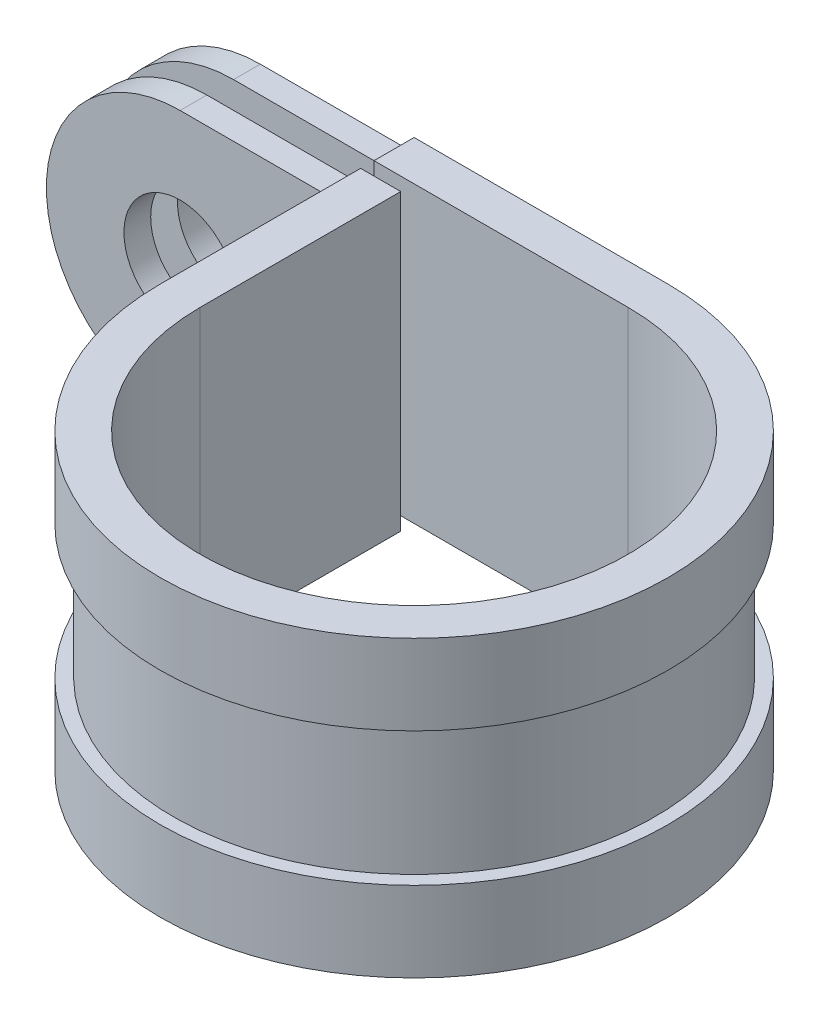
ISO-10303-21;
HEADER;
FILE_DESCRIPTION(('STEP AP214'),'2;1');
FILE_NAME('part.step','',(''),(''),'','','');
FILE_SCHEMA(('AUTOMOTIVE_DESIGN { 1 0 10303 214 1 1 1 1 }'));
ENDSEC;
DATA;
#1=APPLICATION_CONTEXT('core data for automotive mechanical design processes');
#2=APPLICATION_PROTOCOL_DEFINITION('international standard','automotive_design',2000,#1);
#3=PRODUCT_CONTEXT('',#1,'mechanical');
#4=PRODUCT('Part','Part','',(#3));
#5=PRODUCT_RELATED_PRODUCT_CATEGORY('part','',(#4));
#6=PRODUCT_DEFINITION_FORMATION('','',#4);
#7=PRODUCT_DEFINITION_CONTEXT('part definition',#1,'design');
#8=PRODUCT_DEFINITION('design','',#6,#7);
#9=PRODUCT_DEFINITION_SHAPE('','',#8);
#10=(LENGTH_UNIT() NAMED_UNIT(*) SI_UNIT(.MILLI.,.METRE.));
#11=(NAMED_UNIT(*) PLANE_ANGLE_UNIT() SI_UNIT($,.RADIAN.));
#12=(NAMED_UNIT(*) SI_UNIT($,.STERADIAN.) SOLID_ANGLE_UNIT());
#13=UNCERTAINTY_MEASURE_WITH_UNIT(LENGTH_MEASURE(1.E-05),#10,'distance_accuracy_value','');
#14=(GEOMETRIC_REPRESENTATION_CONTEXT(3) GLOBAL_UNCERTAINTY_ASSIGNED_CONTEXT((#13)) GLOBAL_UNIT_ASSIGNED_CONTEXT((#10,
#11,#12)) REPRESENTATION_CONTEXT('',''));
#15=CARTESIAN_POINT('',(0.,0.,0.));
#16=DIRECTION('',(0.,0.,1.));
#17=DIRECTION('',(1.,0.,0.));
#18=AXIS2_PLACEMENT_3D('',#15,#16,#17);
#19=CARTESIAN_POINT('',(104.5,35.5,1071.));
#20=DIRECTION('',(0.,0.,1.));
#21=DIRECTION('',(1.,0.,0.));
#22=AXIS2_PLACEMENT_3D('',#19,#20,#21);
#23=PLANE('',#22);
#24=DIRECTION('',(0.,1.,0.));
#25=VECTOR('',#24,1.);
#26=CARTESIAN_POINT('',(85.5,40.5,1071.));
#27=LINE('',#26,#25);
#28=CARTESIAN_POINT('',(85.5,45.5,1071.));
#29=VERTEX_POINT('',#28);
#30=CARTESIAN_POINT('',(85.5,35.5,1071.));
#31=VERTEX_POINT('',#30);
#32=EDGE_CURVE('E339',#29,#31,#27,.F.);
#33=ORIENTED_EDGE('',*,*,#32,.F.);
#34=DIRECTION('',(1.,0.,0.));
#35=VECTOR('',#34,1.);
#36=CARTESIAN_POINT('',(104.5,45.5,1071.));
#37=LINE('',#36,#35);
#38=CARTESIAN_POINT('',(104.5,45.5,1071.));
#39=VERTEX_POINT('',#38);
#40=EDGE_CURVE('E142',#29,#39,#37,.T.);
#41=ORIENTED_EDGE('',*,*,#40,.T.);
#42=DIRECTION('',(0.,-1.,0.));
#43=VECTOR('',#42,1.);
#44=CARTESIAN_POINT('',(104.5,29.5,1071.));
#45=LINE('',#44,#43);
#46=CARTESIAN_POINT('',(104.5,35.5,1071.));
#47=VERTEX_POINT('',#46);
#48=EDGE_CURVE('E128',#47,#39,#45,.F.);
#49=ORIENTED_EDGE('',*,*,#48,.F.);
#50=DIRECTION('',(1.,0.,0.));
#51=VECTOR('',#50,1.);
#52=CARTESIAN_POINT('',(104.5,35.5,1071.));
#53=LINE('',#52,#51);
#54=EDGE_CURVE('E328',#31,#47,#53,.T.);
#55=ORIENTED_EDGE('',*,*,#54,.F.);
#56=EDGE_LOOP('',(#33,#41,#49,#55));
#57=FACE_BOUND('',#56,.T.);
#58=ADVANCED_FACE('F24',(#57),#23,.F.);
#59=CARTESIAN_POINT('',(104.5,29.5,1089.));
#60=DIRECTION('',(0.,-1.,0.));
#61=DIRECTION('',(1.,0.,0.));
#62=AXIS2_PLACEMENT_3D('',#59,#60,#61);
#63=CYLINDRICAL_SURFACE('',#62,18.);
#64=DIRECTION('',(0.,-1.,0.));
#65=VECTOR('',#64,1.);
#66=CARTESIAN_POINT('',(86.5,35.5,1089.));
#67=LINE('',#66,#65);
#68=CARTESIAN_POINT('',(86.5,35.5,1089.));
#69=VERTEX_POINT('',#68);
#70=CARTESIAN_POINT('',(86.5,45.5,1089.));
#71=VERTEX_POINT('',#70);
#72=EDGE_CURVE('E136',#69,#71,#67,.F.);
#73=ORIENTED_EDGE('',*,*,#72,.F.);
#74=CARTESIAN_POINT('',(104.5,35.5,1089.));
#75=DIRECTION('',(0.,-1.,0.));
#76=DIRECTION('',(1.,0.,0.));
#77=AXIS2_PLACEMENT_3D('',#74,#75,#76);
#78=CIRCLE('',#77,18.);
#79=EDGE_CURVE('E327',#47,#69,#78,.T.);
#80=ORIENTED_EDGE('',*,*,#79,.F.);
#81=ORIENTED_EDGE('',*,*,#48,.T.);
#82=CARTESIAN_POINT('',(104.5,45.5,1089.));
#83=DIRECTION('',(0.,-1.,0.));
#84=DIRECTION('',(1.,0.,0.));
#85=AXIS2_PLACEMENT_3D('',#82,#83,#84);
#86=CIRCLE('',#85,18.);
#87=EDGE_CURVE('E27',#39,#71,#86,.T.);
#88=ORIENTED_EDGE('',*,*,#87,.T.);
#89=EDGE_LOOP('',(#73,#80,#81,#88));
#90=FACE_BOUND('',#89,.T.);
#91=ADVANCED_FACE('F383',(#90),#63,.T.);
#92=CARTESIAN_POINT('',(86.5,35.5,1089.));
#93=DIRECTION('',(-1.,0.,0.));
#94=DIRECTION('',(0.,-1.,0.));
#95=AXIS2_PLACEMENT_3D('',#92,#93,#94);
#96=PLANE('',#95);
#97=ORIENTED_EDGE('',*,*,#72,.T.);
#98=DIRECTION('',(0.,0.,1.));
#99=VECTOR('',#98,1.);
#100=CARTESIAN_POINT('',(86.5,45.5,1071.));
#101=LINE('',#100,#99);
#102=CARTESIAN_POINT('',(86.5,45.5,1076.));
#103=VERTEX_POINT('',#102);
#104=EDGE_CURVE('E343',#71,#103,#101,.F.);
#105=ORIENTED_EDGE('',*,*,#104,.T.);
#106=DIRECTION('',(0.,1.,0.));
#107=VECTOR('',#106,1.);
#108=CARTESIAN_POINT('',(86.5,40.5,1076.));
#109=LINE('',#108,#107);
#110=CARTESIAN_POINT('',(86.5,35.5,1076.));
#111=VERTEX_POINT('',#110);
#112=EDGE_CURVE('E319',#111,#103,#109,.T.);
#113=ORIENTED_EDGE('',*,*,#112,.F.);
#114=DIRECTION('',(0.,0.,1.));
#115=VECTOR('',#114,1.);
#116=CARTESIAN_POINT('',(86.5,35.5,1071.));
#117=LINE('',#116,#115);
#118=EDGE_CURVE('E324',#69,#111,#117,.F.);
#119=ORIENTED_EDGE('',*,*,#118,.F.);
#120=EDGE_LOOP('',(#97,#105,#113,#119));
#121=FACE_BOUND('',#120,.T.);
#122=ADVANCED_FACE('F385',(#121),#96,.T.);
#123=CARTESIAN_POINT('',(74.,40.5,1070.));
#124=DIRECTION('',(0.,0.,1.));
#125=DIRECTION('',(1.,0.,0.));
#126=AXIS2_PLACEMENT_3D('',#123,#124,#125);
#127=CYLINDRICAL_SURFACE('',#126,10.);
#128=CARTESIAN_POINT('',(74.,40.5,1070.));
#129=DIRECTION('',(0.,0.,1.));
#130=DIRECTION('',(1.,0.,0.));
#131=AXIS2_PLACEMENT_3D('',#128,#129,#130);
#132=CIRCLE('',#131,10.);
#133=CARTESIAN_POINT('',(74.,30.5,1070.));
#134=VERTEX_POINT('',#133);
#135=CARTESIAN_POINT('',(74.,50.5,1070.));
#136=VERTEX_POINT('',#135);
#137=EDGE_CURVE('E273',#134,#136,#132,.F.);
#138=ORIENTED_EDGE('',*,*,#137,.F.);
#139=DIRECTION('',(0.,0.,1.));
#140=VECTOR('',#139,1.);
#141=CARTESIAN_POINT('',(74.,30.5,1071.));
#142=LINE('',#141,#140);
#143=CARTESIAN_POINT('',(74.,30.5,1072.));
#144=VERTEX_POINT('',#143);
#145=EDGE_CURVE('E348',#144,#134,#142,.F.);
#146=ORIENTED_EDGE('',*,*,#145,.F.);
#147=CARTESIAN_POINT('',(74.,40.5,1072.));
#148=DIRECTION('',(0.,0.,1.));
#149=DIRECTION('',(1.,0.,0.));
#150=AXIS2_PLACEMENT_3D('',#147,#148,#149);
#151=CIRCLE('',#150,10.);
#152=CARTESIAN_POINT('',(74.,50.5,1072.));
#153=VERTEX_POINT('',#152);
#154=EDGE_CURVE('E299',#153,#144,#151,.T.);
#155=ORIENTED_EDGE('',*,*,#154,.F.);
#156=DIRECTION('',(0.,0.,1.));
#157=VECTOR('',#156,1.);
#158=CARTESIAN_POINT('',(74.,50.5,1071.));
#159=LINE('',#158,#157);
#160=EDGE_CURVE('E294',#136,#153,#159,.T.);
#161=ORIENTED_EDGE('',*,*,#160,.F.);
#162=EDGE_LOOP('',(#138,#146,#155,#161));
#163=FACE_BOUND('',#162,.T.);
#164=ADVANCED_FACE('F511',(#163),#127,.T.);
#165=CARTESIAN_POINT('',(104.5,45.5,1071.));
#166=DIRECTION('',(0.,1.,0.));
#167=DIRECTION('',(0.,0.,1.));
#168=AXIS2_PLACEMENT_3D('',#165,#166,#167);
#169=PLANE('',#168);
#170=DIRECTION('',(1.,0.,0.));
#171=VECTOR('',#170,1.);
#172=CARTESIAN_POINT('',(74.,45.5,1076.));
#173=LINE('',#172,#171);
#174=CARTESIAN_POINT('',(85.5,45.5,1076.));
#175=VERTEX_POINT('',#174);
#176=EDGE_CURVE('E326',#103,#175,#173,.F.);
#177=ORIENTED_EDGE('',*,*,#176,.F.);
#178=ORIENTED_EDGE('',*,*,#104,.F.);
#179=ORIENTED_EDGE('',*,*,#87,.F.);
#180=ORIENTED_EDGE('',*,*,#40,.F.);
#181=DIRECTION('',(0.,0.,1.));
#182=VECTOR('',#181,1.);
#183=CARTESIAN_POINT('',(85.5,45.5,1071.));
#184=LINE('',#183,#182);
#185=CARTESIAN_POINT('',(85.5,45.5,1070.));
#186=VERTEX_POINT('',#185);
#187=EDGE_CURVE('E341',#186,#29,#184,.T.);
#188=ORIENTED_EDGE('',*,*,#187,.F.);
#189=DIRECTION('',(-1.,0.,0.));
#190=VECTOR('',#189,1.);
#191=CARTESIAN_POINT('',(104.5,45.5,1070.));
#192=LINE('',#191,#190);
#193=CARTESIAN_POINT('',(104.5,45.5,1070.));
#194=VERTEX_POINT('',#193);
#195=EDGE_CURVE('E281',#194,#186,#192,.T.);
#196=ORIENTED_EDGE('',*,*,#195,.F.);
#197=CARTESIAN_POINT('',(104.5,45.5,1089.));
#198=DIRECTION('',(0.,-1.,0.));
#199=DIRECTION('',(1.,0.,0.));
#200=AXIS2_PLACEMENT_3D('',#197,#198,#199);
#201=CIRCLE('',#200,19.);
#202=CARTESIAN_POINT('',(85.5,45.5,1089.));
#203=VERTEX_POINT('',#202);
#204=EDGE_CURVE('E293',#203,#194,#201,.F.);
#205=ORIENTED_EDGE('',*,*,#204,.F.);
#206=DIRECTION('',(0.,0.,1.));
#207=VECTOR('',#206,1.);
#208=CARTESIAN_POINT('',(85.5,45.5,1089.));
#209=LINE('',#208,#207);
#210=EDGE_CURVE('E287',#175,#203,#209,.T.);
#211=ORIENTED_EDGE('',*,*,#210,.F.);
#212=EDGE_LOOP('',(#177,#178,#179,#180,#188,#196,#205,#211));
#213=FACE_BOUND('',#212,.T.);
#214=ADVANCED_FACE('F391',(#213),#169,.F.);
#215=CARTESIAN_POINT('',(85.5,40.5,1071.));
#216=DIRECTION('',(1.,0.,0.));
#217=DIRECTION('',(0.,1.,0.));
#218=AXIS2_PLACEMENT_3D('',#215,#216,#217);
#219=PLANE('',#218);
#220=DIRECTION('',(0.,0.,1.));
#221=VECTOR('',#220,1.);
#222=CARTESIAN_POINT('',(85.5,35.5,1071.));
#223=LINE('',#222,#221);
#224=CARTESIAN_POINT('',(85.5,35.5,1070.));
#225=VERTEX_POINT('',#224);
#226=EDGE_CURVE('E330',#225,#31,#223,.T.);
#227=ORIENTED_EDGE('',*,*,#226,.F.);
#228=DIRECTION('',(0.,1.,0.));
#229=VECTOR('',#228,1.);
#230=CARTESIAN_POINT('',(85.5,35.5,1070.));
#231=LINE('',#230,#229);
#232=EDGE_CURVE('E336',#186,#225,#231,.F.);
#233=ORIENTED_EDGE('',*,*,#232,.F.);
#234=ORIENTED_EDGE('',*,*,#187,.T.);
#235=ORIENTED_EDGE('',*,*,#32,.T.);
#236=EDGE_LOOP('',(#227,#233,#234,#235));
#237=FACE_BOUND('',#236,.T.);
#238=ADVANCED_FACE('F430',(#237),#219,.T.);
#239=CARTESIAN_POINT('',(74.,40.5,1072.));
#240=DIRECTION('',(0.,0.,-1.));
#241=DIRECTION('',(-1.,0.,0.));
#242=AXIS2_PLACEMENT_3D('',#239,#240,#241);
#243=CYLINDRICAL_SURFACE('',#242,4.2);
#244=CARTESIAN_POINT('',(74.,40.5,1072.));
#245=DIRECTION('',(0.,0.,-1.));
#246=DIRECTION('',(-1.,0.,0.));
#247=AXIS2_PLACEMENT_3D('',#244,#245,#246);
#248=CIRCLE('',#247,4.2);
#249=CARTESIAN_POINT('',(69.8,40.5,1072.));
#250=VERTEX_POINT('',#249);
#251=EDGE_CURVE('E350',#250,#250,#248,.T.);
#252=ORIENTED_EDGE('',*,*,#251,.F.);
#253=EDGE_LOOP('',(#252));
#254=FACE_BOUND('',#253,.T.);
#255=CARTESIAN_POINT('',(74.,40.5,1070.));
#256=DIRECTION('',(0.,0.,-1.));
#257=DIRECTION('',(-1.,0.,0.));
#258=AXIS2_PLACEMENT_3D('',#255,#256,#257);
#259=CIRCLE('',#258,4.2);
#260=CARTESIAN_POINT('',(69.8,40.5,1070.));
#261=VERTEX_POINT('',#260);
#262=EDGE_CURVE('E269',#261,#261,#259,.F.);
#263=ORIENTED_EDGE('',*,*,#262,.F.);
#264=EDGE_LOOP('',(#263));
#265=FACE_BOUND('',#264,.T.);
#266=ADVANCED_FACE('F503',(#254,#265),#243,.F.);
#267=CARTESIAN_POINT('',(104.5,35.5,1071.));
#268=DIRECTION('',(0.,1.,0.));
#269=DIRECTION('',(0.,0.,1.));
#270=AXIS2_PLACEMENT_3D('',#267,#268,#269);
#271=PLANE('',#270);
#272=ORIENTED_EDGE('',*,*,#79,.T.);
#273=ORIENTED_EDGE('',*,*,#118,.T.);
#274=DIRECTION('',(1.,0.,0.));
#275=VECTOR('',#274,1.);
#276=CARTESIAN_POINT('',(74.,35.5,1076.));
#277=LINE('',#276,#275);
#278=CARTESIAN_POINT('',(85.5,35.5,1076.));
#279=VERTEX_POINT('',#278);
#280=EDGE_CURVE('E331',#279,#111,#277,.T.);
#281=ORIENTED_EDGE('',*,*,#280,.F.);
#282=DIRECTION('',(0.,0.,1.));
#283=VECTOR('',#282,1.);
#284=CARTESIAN_POINT('',(85.5,35.5,1089.));
#285=LINE('',#284,#283);
#286=CARTESIAN_POINT('',(85.5,35.5,1089.));
#287=VERTEX_POINT('',#286);
#288=EDGE_CURVE('E264',#279,#287,#285,.T.);
#289=ORIENTED_EDGE('',*,*,#288,.T.);
#290=CARTESIAN_POINT('',(104.5,35.5,1089.));
#291=DIRECTION('',(0.,-1.,0.));
#292=DIRECTION('',(1.,0.,0.));
#293=AXIS2_PLACEMENT_3D('',#290,#291,#292);
#294=CIRCLE('',#293,19.);
#295=CARTESIAN_POINT('',(104.5,35.5,1070.));
#296=VERTEX_POINT('',#295);
#297=EDGE_CURVE('E268',#296,#287,#294,.T.);
#298=ORIENTED_EDGE('',*,*,#297,.F.);
#299=DIRECTION('',(-1.,0.,0.));
#300=VECTOR('',#299,1.);
#301=CARTESIAN_POINT('',(104.5,35.5,1070.));
#302=LINE('',#301,#300);
#303=EDGE_CURVE('E334',#225,#296,#302,.F.);
#304=ORIENTED_EDGE('',*,*,#303,.F.);
#305=ORIENTED_EDGE('',*,*,#226,.T.);
#306=ORIENTED_EDGE('',*,*,#54,.T.);
#307=EDGE_LOOP('',(#272,#273,#281,#289,#298,#304,#305,#306));
#308=FACE_BOUND('',#307,.T.);
#309=ADVANCED_FACE('F380',(#308),#271,.T.);
#310=CARTESIAN_POINT('',(74.,40.5,1076.));
#311=DIRECTION('',(0.,0.,1.));
#312=DIRECTION('',(1.,0.,0.));
#313=AXIS2_PLACEMENT_3D('',#310,#311,#312);
#314=PLANE('',#313);
#315=CARTESIAN_POINT('',(74.,40.5,1076.));
#316=DIRECTION('',(0.,0.,-1.));
#317=DIRECTION('',(-1.,0.,0.));
#318=AXIS2_PLACEMENT_3D('',#315,#316,#317);
#319=CIRCLE('',#318,4.2);
#320=CARTESIAN_POINT('',(69.8,40.5,1076.));
#321=VERTEX_POINT('',#320);
#322=EDGE_CURVE('E309',#321,#321,#319,.T.);
#323=ORIENTED_EDGE('',*,*,#322,.T.);
#324=EDGE_LOOP('',(#323));
#325=FACE_BOUND('',#324,.T.);
#326=ORIENTED_EDGE('',*,*,#280,.T.);
#327=ORIENTED_EDGE('',*,*,#112,.T.);
#328=ORIENTED_EDGE('',*,*,#176,.T.);
#329=DIRECTION('',(0.,-1.,0.));
#330=VECTOR('',#329,1.);
#331=CARTESIAN_POINT('',(85.5,45.5,1076.));
#332=LINE('',#331,#330);
#333=CARTESIAN_POINT('',(85.5,50.5,1076.));
#334=VERTEX_POINT('',#333);
#335=EDGE_CURVE('E305',#334,#175,#332,.T.);
#336=ORIENTED_EDGE('',*,*,#335,.F.);
#337=DIRECTION('',(-1.,0.,0.));
#338=VECTOR('',#337,1.);
#339=CARTESIAN_POINT('',(87.,50.5,1076.));
#340=LINE('',#339,#338);
#341=CARTESIAN_POINT('',(74.,50.5,1076.));
#342=VERTEX_POINT('',#341);
#343=EDGE_CURVE('E310',#342,#334,#340,.F.);
#344=ORIENTED_EDGE('',*,*,#343,.F.);
#345=CARTESIAN_POINT('',(74.,40.5,1076.));
#346=DIRECTION('',(0.,0.,1.));
#347=DIRECTION('',(1.,0.,0.));
#348=AXIS2_PLACEMENT_3D('',#345,#346,#347);
#349=CIRCLE('',#348,10.);
#350=CARTESIAN_POINT('',(74.,30.5,1076.));
#351=VERTEX_POINT('',#350);
#352=EDGE_CURVE('E314',#351,#342,#349,.F.);
#353=ORIENTED_EDGE('',*,*,#352,.F.);
#354=DIRECTION('',(1.,0.,0.));
#355=VECTOR('',#354,1.);
#356=CARTESIAN_POINT('',(87.,30.5,1076.));
#357=LINE('',#356,#355);
#358=CARTESIAN_POINT('',(85.5,30.5,1076.));
#359=VERTEX_POINT('',#358);
#360=EDGE_CURVE('E317',#359,#351,#357,.F.);
#361=ORIENTED_EDGE('',*,*,#360,.F.);
#362=DIRECTION('',(0.,1.,0.));
#363=VECTOR('',#362,1.);
#364=CARTESIAN_POINT('',(85.5,35.5,1076.));
#365=LINE('',#364,#363);
#366=EDGE_CURVE('E259',#359,#279,#365,.T.);
#367=ORIENTED_EDGE('',*,*,#366,.T.);
#368=EDGE_LOOP('',(#326,#327,#328,#336,#344,#353,#361,#367));
#369=FACE_BOUND('',#368,.T.);
#370=ADVANCED_FACE('F388',(#325,#369),#314,.T.);
#371=CARTESIAN_POINT('',(87.,30.5,1075.));
#372=DIRECTION('',(0.,-1.,0.));
#373=DIRECTION('',(1.,0.,0.));
#374=AXIS2_PLACEMENT_3D('',#371,#372,#373);
#375=PLANE('',#374);
#376=DIRECTION('',(0.,0.,1.));
#377=VECTOR('',#376,1.);
#378=CARTESIAN_POINT('',(74.,30.5,1074.));
#379=LINE('',#378,#377);
#380=CARTESIAN_POINT('',(74.,30.5,1074.));
#381=VERTEX_POINT('',#380);
#382=EDGE_CURVE('E311',#381,#351,#379,.T.);
#383=ORIENTED_EDGE('',*,*,#382,.F.);
#384=DIRECTION('',(-1.,0.,0.));
#385=VECTOR('',#384,1.);
#386=CARTESIAN_POINT('',(88.5,30.5,1074.));
#387=LINE('',#386,#385);
#388=CARTESIAN_POINT('',(85.5,30.5,1074.));
#389=VERTEX_POINT('',#388);
#390=EDGE_CURVE('E254',#389,#381,#387,.T.);
#391=ORIENTED_EDGE('',*,*,#390,.F.);
#392=DIRECTION('',(0.,0.,1.));
#393=VECTOR('',#392,1.);
#394=CARTESIAN_POINT('',(85.5,30.5,1089.));
#395=LINE('',#394,#393);
#396=EDGE_CURVE('E263',#389,#359,#395,.T.);
#397=ORIENTED_EDGE('',*,*,#396,.T.);
#398=ORIENTED_EDGE('',*,*,#360,.T.);
#399=EDGE_LOOP('',(#383,#391,#397,#398));
#400=FACE_BOUND('',#399,.T.);
#401=ADVANCED_FACE('F412',(#400),#375,.T.);
#402=CARTESIAN_POINT('',(74.,40.5,1074.));
#403=DIRECTION('',(0.,0.,1.));
#404=DIRECTION('',(1.,0.,0.));
#405=AXIS2_PLACEMENT_3D('',#402,#403,#404);
#406=CYLINDRICAL_SURFACE('',#405,10.);
#407=CARTESIAN_POINT('',(74.,40.5,1074.));
#408=DIRECTION('',(0.,0.,1.));
#409=DIRECTION('',(1.,0.,0.));
#410=AXIS2_PLACEMENT_3D('',#407,#408,#409);
#411=CIRCLE('',#410,10.);
#412=CARTESIAN_POINT('',(74.,50.5,1074.));
#413=VERTEX_POINT('',#412);
#414=EDGE_CURVE('E253',#381,#413,#411,.F.);
#415=ORIENTED_EDGE('',*,*,#414,.F.);
#416=ORIENTED_EDGE('',*,*,#382,.T.);
#417=ORIENTED_EDGE('',*,*,#352,.T.);
#418=DIRECTION('',(0.,0.,1.));
#419=VECTOR('',#418,1.);
#420=CARTESIAN_POINT('',(74.,50.5,1075.));
#421=LINE('',#420,#419);
#422=EDGE_CURVE('E306',#413,#342,#421,.T.);
#423=ORIENTED_EDGE('',*,*,#422,.F.);
#424=EDGE_LOOP('',(#415,#416,#417,#423));
#425=FACE_BOUND('',#424,.T.);
#426=ADVANCED_FACE('F408',(#425),#406,.T.);
#427=CARTESIAN_POINT('',(87.,50.5,1075.));
#428=DIRECTION('',(0.,1.,0.));
#429=DIRECTION('',(-1.,0.,0.));
#430=AXIS2_PLACEMENT_3D('',#427,#428,#429);
#431=PLANE('',#430);
#432=DIRECTION('',(-1.,0.,0.));
#433=VECTOR('',#432,1.);
#434=CARTESIAN_POINT('',(88.5,50.5,1074.));
#435=LINE('',#434,#433);
#436=CARTESIAN_POINT('',(85.5,50.5,1074.));
#437=VERTEX_POINT('',#436);
#438=EDGE_CURVE('E250',#413,#437,#435,.F.);
#439=ORIENTED_EDGE('',*,*,#438,.F.);
#440=ORIENTED_EDGE('',*,*,#422,.T.);
#441=ORIENTED_EDGE('',*,*,#343,.T.);
#442=DIRECTION('',(0.,0.,1.));
#443=VECTOR('',#442,1.);
#444=CARTESIAN_POINT('',(85.5,50.5,1089.));
#445=LINE('',#444,#443);
#446=EDGE_CURVE('E302',#437,#334,#445,.T.);
#447=ORIENTED_EDGE('',*,*,#446,.F.);
#448=EDGE_LOOP('',(#439,#440,#441,#447));
#449=FACE_BOUND('',#448,.T.);
#450=ADVANCED_FACE('F404',(#449),#431,.T.);
#451=CARTESIAN_POINT('',(74.,40.5,1076.));
#452=DIRECTION('',(0.,0.,-1.));
#453=DIRECTION('',(-1.,0.,0.));
#454=AXIS2_PLACEMENT_3D('',#451,#452,#453);
#455=CYLINDRICAL_SURFACE('',#454,4.2);
#456=ORIENTED_EDGE('',*,*,#322,.F.);
#457=EDGE_LOOP('',(#456));
#458=FACE_BOUND('',#457,.T.);
#459=CARTESIAN_POINT('',(74.,40.5,1074.));
#460=DIRECTION('',(0.,0.,-1.));
#461=DIRECTION('',(-1.,0.,0.));
#462=AXIS2_PLACEMENT_3D('',#459,#460,#461);
#463=CIRCLE('',#462,4.2);
#464=CARTESIAN_POINT('',(69.8,40.5,1074.));
#465=VERTEX_POINT('',#464);
#466=EDGE_CURVE('E243',#465,#465,#463,.F.);
#467=ORIENTED_EDGE('',*,*,#466,.F.);
#468=EDGE_LOOP('',(#467));
#469=FACE_BOUND('',#468,.T.);
#470=ADVANCED_FACE('F487',(#458,#469),#455,.F.);
#471=CARTESIAN_POINT('',(85.5,30.5,1071.));
#472=DIRECTION('',(0.,-1.,0.));
#473=DIRECTION('',(1.,0.,0.));
#474=AXIS2_PLACEMENT_3D('',#471,#472,#473);
#475=PLANE('',#474);
#476=ORIENTED_EDGE('',*,*,#145,.T.);
#477=DIRECTION('',(-1.,0.,0.));
#478=VECTOR('',#477,1.);
#479=CARTESIAN_POINT('',(104.5,30.5,1070.));
#480=LINE('',#479,#478);
#481=CARTESIAN_POINT('',(85.5,30.5,1070.));
#482=VERTEX_POINT('',#481);
#483=EDGE_CURVE('E274',#482,#134,#480,.T.);
#484=ORIENTED_EDGE('',*,*,#483,.F.);
#485=DIRECTION('',(0.,0.,1.));
#486=VECTOR('',#485,1.);
#487=CARTESIAN_POINT('',(85.5,30.5,1073.));
#488=LINE('',#487,#486);
#489=CARTESIAN_POINT('',(85.5,30.5,1072.));
#490=VERTEX_POINT('',#489);
#491=EDGE_CURVE('E242',#482,#490,#488,.T.);
#492=ORIENTED_EDGE('',*,*,#491,.T.);
#493=DIRECTION('',(1.,0.,0.));
#494=VECTOR('',#493,1.);
#495=CARTESIAN_POINT('',(74.,30.5,1072.));
#496=LINE('',#495,#494);
#497=EDGE_CURVE('E297',#144,#490,#496,.T.);
#498=ORIENTED_EDGE('',*,*,#497,.F.);
#499=EDGE_LOOP('',(#476,#484,#492,#498));
#500=FACE_BOUND('',#499,.T.);
#501=ADVANCED_FACE('F483',(#500),#475,.T.);
#502=CARTESIAN_POINT('',(74.,40.5,1072.));
#503=DIRECTION('',(0.,0.,1.));
#504=DIRECTION('',(1.,0.,0.));
#505=AXIS2_PLACEMENT_3D('',#502,#503,#504);
#506=PLANE('',#505);
#507=DIRECTION('',(0.,1.,0.));
#508=VECTOR('',#507,1.);
#509=CARTESIAN_POINT('',(85.5,51.5,1072.));
#510=LINE('',#509,#508);
#511=CARTESIAN_POINT('',(85.5,50.5,1072.));
#512=VERTEX_POINT('',#511);
#513=EDGE_CURVE('E290',#490,#512,#510,.T.);
#514=ORIENTED_EDGE('',*,*,#513,.T.);
#515=DIRECTION('',(-1.,0.,0.));
#516=VECTOR('',#515,1.);
#517=CARTESIAN_POINT('',(85.5,50.5,1072.));
#518=LINE('',#517,#516);
#519=EDGE_CURVE('E291',#153,#512,#518,.F.);
#520=ORIENTED_EDGE('',*,*,#519,.F.);
#521=ORIENTED_EDGE('',*,*,#154,.T.);
#522=ORIENTED_EDGE('',*,*,#497,.T.);
#523=EDGE_LOOP('',(#514,#520,#521,#522));
#524=FACE_BOUND('',#523,.T.);
#525=ORIENTED_EDGE('',*,*,#251,.T.);
#526=EDGE_LOOP('',(#525));
#527=FACE_BOUND('',#526,.T.);
#528=ADVANCED_FACE('F479',(#524,#527),#506,.T.);
#529=CARTESIAN_POINT('',(85.5,50.5,1071.));
#530=DIRECTION('',(0.,1.,0.));
#531=DIRECTION('',(-1.,0.,0.));
#532=AXIS2_PLACEMENT_3D('',#529,#530,#531);
#533=PLANE('',#532);
#534=ORIENTED_EDGE('',*,*,#519,.T.);
#535=DIRECTION('',(0.,0.,1.));
#536=VECTOR('',#535,1.);
#537=CARTESIAN_POINT('',(85.5,50.5,1073.));
#538=LINE('',#537,#536);
#539=CARTESIAN_POINT('',(85.5,50.5,1070.));
#540=VERTEX_POINT('',#539);
#541=EDGE_CURVE('E284',#512,#540,#538,.F.);
#542=ORIENTED_EDGE('',*,*,#541,.T.);
#543=DIRECTION('',(-1.,0.,0.));
#544=VECTOR('',#543,1.);
#545=CARTESIAN_POINT('',(104.5,50.5,1070.));
#546=LINE('',#545,#544);
#547=EDGE_CURVE('E270',#136,#540,#546,.F.);
#548=ORIENTED_EDGE('',*,*,#547,.F.);
#549=ORIENTED_EDGE('',*,*,#160,.T.);
#550=EDGE_LOOP('',(#534,#542,#548,#549));
#551=FACE_BOUND('',#550,.T.);
#552=ADVANCED_FACE('F475',(#551),#533,.T.);
#553=CARTESIAN_POINT('',(104.5,29.5,1089.));
#554=DIRECTION('',(0.,-1.,0.));
#555=DIRECTION('',(1.,0.,0.));
#556=AXIS2_PLACEMENT_3D('',#553,#554,#555);
#557=CYLINDRICAL_SURFACE('',#556,19.);
#558=DIRECTION('',(0.,-1.,0.));
#559=VECTOR('',#558,1.);
#560=CARTESIAN_POINT('',(85.5,45.5,1089.));
#561=LINE('',#560,#559);
#562=CARTESIAN_POINT('',(85.5,51.5,1089.));
#563=VERTEX_POINT('',#562);
#564=EDGE_CURVE('E277',#203,#563,#561,.F.);
#565=ORIENTED_EDGE('',*,*,#564,.F.);
#566=ORIENTED_EDGE('',*,*,#204,.T.);
#567=DIRECTION('',(0.,1.,0.));
#568=VECTOR('',#567,1.);
#569=CARTESIAN_POINT('',(104.5,35.5,1070.));
#570=LINE('',#569,#568);
#571=CARTESIAN_POINT('',(104.5,51.5,1070.));
#572=VERTEX_POINT('',#571);
#573=EDGE_CURVE('E272',#572,#194,#570,.F.);
#574=ORIENTED_EDGE('',*,*,#573,.F.);
#575=CARTESIAN_POINT('',(104.5,51.5,1089.));
#576=DIRECTION('',(0.,-1.,0.));
#577=DIRECTION('',(1.,0.,0.));
#578=AXIS2_PLACEMENT_3D('',#575,#576,#577);
#579=CIRCLE('',#578,19.);
#580=EDGE_CURVE('E238',#572,#563,#579,.T.);
#581=ORIENTED_EDGE('',*,*,#580,.T.);
#582=EDGE_LOOP('',(#565,#566,#574,#581));
#583=FACE_BOUND('',#582,.T.);
#584=ADVANCED_FACE('F472',(#583),#557,.T.);
#585=CARTESIAN_POINT('',(85.5,45.5,1089.));
#586=DIRECTION('',(-1.,0.,0.));
#587=DIRECTION('',(0.,-1.,0.));
#588=AXIS2_PLACEMENT_3D('',#585,#586,#587);
#589=PLANE('',#588);
#590=DIRECTION('',(0.,0.,-1.));
#591=VECTOR('',#590,1.);
#592=CARTESIAN_POINT('',(85.5,51.5,1070.));
#593=LINE('',#592,#591);
#594=CARTESIAN_POINT('',(85.5,51.5,1074.));
#595=VERTEX_POINT('',#594);
#596=EDGE_CURVE('E234',#563,#595,#593,.T.);
#597=ORIENTED_EDGE('',*,*,#596,.T.);
#598=DIRECTION('',(0.,1.,0.));
#599=VECTOR('',#598,1.);
#600=CARTESIAN_POINT('',(85.5,51.5,1074.));
#601=LINE('',#600,#599);
#602=EDGE_CURVE('E252',#437,#595,#601,.T.);
#603=ORIENTED_EDGE('',*,*,#602,.F.);
#604=ORIENTED_EDGE('',*,*,#446,.T.);
#605=ORIENTED_EDGE('',*,*,#335,.T.);
#606=ORIENTED_EDGE('',*,*,#210,.T.);
#607=ORIENTED_EDGE('',*,*,#564,.T.);
#608=EDGE_LOOP('',(#597,#603,#604,#605,#606,#607));
#609=FACE_BOUND('',#608,.T.);
#610=ADVANCED_FACE('F396',(#609),#589,.T.);
#611=CARTESIAN_POINT('',(104.5,35.5,1070.));
#612=DIRECTION('',(0.,0.,-1.));
#613=DIRECTION('',(-1.,0.,0.));
#614=AXIS2_PLACEMENT_3D('',#611,#612,#613);
#615=PLANE('',#614);
#616=ORIENTED_EDGE('',*,*,#262,.T.);
#617=EDGE_LOOP('',(#616));
#618=FACE_BOUND('',#617,.T.);
#619=ORIENTED_EDGE('',*,*,#303,.T.);
#620=DIRECTION('',(0.,-1.,0.));
#621=VECTOR('',#620,1.);
#622=CARTESIAN_POINT('',(104.5,29.5,1070.));
#623=LINE('',#622,#621);
#624=CARTESIAN_POINT('',(104.5,29.5,1070.));
#625=VERTEX_POINT('',#624);
#626=EDGE_CURVE('E265',#625,#296,#623,.F.);
#627=ORIENTED_EDGE('',*,*,#626,.F.);
#628=DIRECTION('',(1.,0.,0.));
#629=VECTOR('',#628,1.);
#630=CARTESIAN_POINT('',(104.5,29.5,1070.));
#631=LINE('',#630,#629);
#632=CARTESIAN_POINT('',(85.5,29.5,1070.));
#633=VERTEX_POINT('',#632);
#634=EDGE_CURVE('E246',#633,#625,#631,.T.);
#635=ORIENTED_EDGE('',*,*,#634,.F.);
#636=DIRECTION('',(0.,1.,0.));
#637=VECTOR('',#636,1.);
#638=CARTESIAN_POINT('',(85.5,51.5,1070.));
#639=LINE('',#638,#637);
#640=EDGE_CURVE('E211',#633,#482,#639,.T.);
#641=ORIENTED_EDGE('',*,*,#640,.T.);
#642=ORIENTED_EDGE('',*,*,#483,.T.);
#643=ORIENTED_EDGE('',*,*,#137,.T.);
#644=ORIENTED_EDGE('',*,*,#547,.T.);
#645=DIRECTION('',(0.,1.,0.));
#646=VECTOR('',#645,1.);
#647=CARTESIAN_POINT('',(85.5,51.5,1070.));
#648=LINE('',#647,#646);
#649=CARTESIAN_POINT('',(85.5,51.5,1070.));
#650=VERTEX_POINT('',#649);
#651=EDGE_CURVE('E282',#540,#650,#648,.T.);
#652=ORIENTED_EDGE('',*,*,#651,.T.);
#653=DIRECTION('',(1.,0.,0.));
#654=VECTOR('',#653,1.);
#655=CARTESIAN_POINT('',(104.5,51.5,1070.));
#656=LINE('',#655,#654);
#657=EDGE_CURVE('E230',#650,#572,#656,.T.);
#658=ORIENTED_EDGE('',*,*,#657,.T.);
#659=ORIENTED_EDGE('',*,*,#573,.T.);
#660=ORIENTED_EDGE('',*,*,#195,.T.);
#661=ORIENTED_EDGE('',*,*,#232,.T.);
#662=EDGE_LOOP('',(#619,#627,#635,#641,#642,#643,#644,#652,#658,#659,#660,#661));
#663=FACE_BOUND('',#662,.T.);
#664=ADVANCED_FACE('F426',(#618,#663),#615,.T.);
#665=CARTESIAN_POINT('',(104.5,29.5,1089.));
#666=DIRECTION('',(0.,-1.,0.));
#667=DIRECTION('',(1.,0.,0.));
#668=AXIS2_PLACEMENT_3D('',#665,#666,#667);
#669=CYLINDRICAL_SURFACE('',#668,19.);
#670=DIRECTION('',(0.,1.,0.));
#671=VECTOR('',#670,1.);
#672=CARTESIAN_POINT('',(85.5,35.5,1089.));
#673=LINE('',#672,#671);
#674=CARTESIAN_POINT('',(85.5,29.5,1089.));
#675=VERTEX_POINT('',#674);
#676=EDGE_CURVE('E260',#287,#675,#673,.F.);
#677=ORIENTED_EDGE('',*,*,#676,.T.);
#678=CARTESIAN_POINT('',(104.5,29.5,1089.));
#679=DIRECTION('',(0.,-1.,0.));
#680=DIRECTION('',(1.,0.,0.));
#681=AXIS2_PLACEMENT_3D('',#678,#679,#680);
#682=CIRCLE('',#681,19.);
#683=EDGE_CURVE('E362',#625,#675,#682,.T.);
#684=ORIENTED_EDGE('',*,*,#683,.F.);
#685=ORIENTED_EDGE('',*,*,#626,.T.);
#686=ORIENTED_EDGE('',*,*,#297,.T.);
#687=EDGE_LOOP('',(#677,#684,#685,#686));
#688=FACE_BOUND('',#687,.T.);
#689=ADVANCED_FACE('F422',(#688),#669,.T.);
#690=CARTESIAN_POINT('',(85.5,35.5,1089.));
#691=DIRECTION('',(1.,0.,0.));
#692=DIRECTION('',(0.,1.,0.));
#693=AXIS2_PLACEMENT_3D('',#690,#691,#692);
#694=PLANE('',#693);
#695=ORIENTED_EDGE('',*,*,#396,.F.);
#696=DIRECTION('',(0.,1.,0.));
#697=VECTOR('',#696,1.);
#698=CARTESIAN_POINT('',(85.5,51.5,1074.));
#699=LINE('',#698,#697);
#700=CARTESIAN_POINT('',(85.5,29.5,1074.));
#701=VERTEX_POINT('',#700);
#702=EDGE_CURVE('E256',#701,#389,#699,.T.);
#703=ORIENTED_EDGE('',*,*,#702,.F.);
#704=DIRECTION('',(0.,0.,-1.));
#705=VECTOR('',#704,1.);
#706=CARTESIAN_POINT('',(85.5,29.5,1070.));
#707=LINE('',#706,#705);
#708=EDGE_CURVE('E249',#675,#701,#707,.T.);
#709=ORIENTED_EDGE('',*,*,#708,.F.);
#710=ORIENTED_EDGE('',*,*,#676,.F.);
#711=ORIENTED_EDGE('',*,*,#288,.F.);
#712=ORIENTED_EDGE('',*,*,#366,.F.);
#713=EDGE_LOOP('',(#695,#703,#709,#710,#711,#712));
#714=FACE_BOUND('',#713,.T.);
#715=ADVANCED_FACE('F415',(#714),#694,.F.);
#716=CARTESIAN_POINT('',(88.5,51.5,1074.));
#717=DIRECTION('',(0.,0.,-1.));
#718=DIRECTION('',(-1.,0.,0.));
#719=AXIS2_PLACEMENT_3D('',#716,#717,#718);
#720=PLANE('',#719);
#721=ORIENTED_EDGE('',*,*,#466,.T.);
#722=EDGE_LOOP('',(#721));
#723=FACE_BOUND('',#722,.T.);
#724=DIRECTION('',(0.,-1.,0.));
#725=VECTOR('',#724,1.);
#726=CARTESIAN_POINT('',(88.5,29.5,1074.));
#727=LINE('',#726,#725);
#728=CARTESIAN_POINT('',(88.5,51.5,1074.));
#729=VERTEX_POINT('',#728);
#730=CARTESIAN_POINT('',(88.5,29.5,1074.));
#731=VERTEX_POINT('',#730);
#732=EDGE_CURVE('E229',#729,#731,#727,.T.);
#733=ORIENTED_EDGE('',*,*,#732,.T.);
#734=DIRECTION('',(1.,0.,0.));
#735=VECTOR('',#734,1.);
#736=CARTESIAN_POINT('',(104.5,29.5,1074.));
#737=LINE('',#736,#735);
#738=EDGE_CURVE('E247',#701,#731,#737,.T.);
#739=ORIENTED_EDGE('',*,*,#738,.F.);
#740=ORIENTED_EDGE('',*,*,#702,.T.);
#741=ORIENTED_EDGE('',*,*,#390,.T.);
#742=ORIENTED_EDGE('',*,*,#414,.T.);
#743=ORIENTED_EDGE('',*,*,#438,.T.);
#744=ORIENTED_EDGE('',*,*,#602,.T.);
#745=DIRECTION('',(1.,0.,0.));
#746=VECTOR('',#745,1.);
#747=CARTESIAN_POINT('',(104.5,51.5,1074.));
#748=LINE('',#747,#746);
#749=EDGE_CURVE('E237',#595,#729,#748,.T.);
#750=ORIENTED_EDGE('',*,*,#749,.T.);
#751=EDGE_LOOP('',(#733,#739,#740,#741,#742,#743,#744,#750));
#752=FACE_BOUND('',#751,.T.);
#753=ADVANCED_FACE('F459',(#723,#752),#720,.T.);
#754=CARTESIAN_POINT('',(85.5,51.5,1073.));
#755=DIRECTION('',(1.,0.,0.));
#756=DIRECTION('',(0.,1.,0.));
#757=AXIS2_PLACEMENT_3D('',#754,#755,#756);
#758=PLANE('',#757);
#759=ORIENTED_EDGE('',*,*,#541,.F.);
#760=ORIENTED_EDGE('',*,*,#513,.F.);
#761=ORIENTED_EDGE('',*,*,#491,.F.);
#762=ORIENTED_EDGE('',*,*,#640,.F.);
#763=DIRECTION('',(0.,0.,-1.));
#764=VECTOR('',#763,1.);
#765=CARTESIAN_POINT('',(85.5,29.5,1070.));
#766=LINE('',#765,#764);
#767=CARTESIAN_POINT('',(85.5,29.5,1073.));
#768=VERTEX_POINT('',#767);
#769=EDGE_CURVE('E206',#768,#633,#766,.T.);
#770=ORIENTED_EDGE('',*,*,#769,.F.);
#771=DIRECTION('',(0.,1.,0.));
#772=VECTOR('',#771,1.);
#773=CARTESIAN_POINT('',(85.5,29.5,1073.));
#774=LINE('',#773,#772);
#775=CARTESIAN_POINT('',(85.5,51.5,1073.));
#776=VERTEX_POINT('',#775);
#777=EDGE_CURVE('E197',#776,#768,#774,.F.);
#778=ORIENTED_EDGE('',*,*,#777,.F.);
#779=DIRECTION('',(0.,0.,-1.));
#780=VECTOR('',#779,1.);
#781=CARTESIAN_POINT('',(85.5,51.5,1070.));
#782=LINE('',#781,#780);
#783=EDGE_CURVE('E233',#776,#650,#782,.T.);
#784=ORIENTED_EDGE('',*,*,#783,.T.);
#785=ORIENTED_EDGE('',*,*,#651,.F.);
#786=EDGE_LOOP('',(#759,#760,#761,#762,#770,#778,#784,#785));
#787=FACE_BOUND('',#786,.T.);
#788=ADVANCED_FACE('F208',(#787),#758,.F.);
#789=CARTESIAN_POINT('',(104.5,51.5,1070.));
#790=DIRECTION('',(0.,-1.,0.));
#791=DIRECTION('',(0.,0.,-1.));
#792=AXIS2_PLACEMENT_3D('',#789,#790,#791);
#793=PLANE('',#792);
#794=ORIENTED_EDGE('',*,*,#783,.F.);
#795=DIRECTION('',(1.,0.,0.));
#796=VECTOR('',#795,1.);
#797=CARTESIAN_POINT('',(104.5,51.5,1073.));
#798=LINE('',#797,#796);
#799=CARTESIAN_POINT('',(104.5,51.5,1073.));
#800=VERTEX_POINT('',#799);
#801=EDGE_CURVE('E201',#800,#776,#798,.F.);
#802=ORIENTED_EDGE('',*,*,#801,.F.);
#803=CARTESIAN_POINT('',(104.5,51.5,1089.));
#804=DIRECTION('',(0.,-1.,0.));
#805=DIRECTION('',(1.,0.,0.));
#806=AXIS2_PLACEMENT_3D('',#803,#804,#805);
#807=CIRCLE('',#806,16.);
#808=CARTESIAN_POINT('',(88.5,51.5,1089.));
#809=VERTEX_POINT('',#808);
#810=EDGE_CURVE('E219',#800,#809,#807,.T.);
#811=ORIENTED_EDGE('',*,*,#810,.T.);
#812=DIRECTION('',(0.,0.,1.));
#813=VECTOR('',#812,1.);
#814=CARTESIAN_POINT('',(88.5,51.5,1089.));
#815=LINE('',#814,#813);
#816=EDGE_CURVE('E226',#809,#729,#815,.F.);
#817=ORIENTED_EDGE('',*,*,#816,.T.);
#818=ORIENTED_EDGE('',*,*,#749,.F.);
#819=ORIENTED_EDGE('',*,*,#596,.F.);
#820=ORIENTED_EDGE('',*,*,#580,.F.);
#821=ORIENTED_EDGE('',*,*,#657,.F.);
#822=EDGE_LOOP('',(#794,#802,#811,#817,#818,#819,#820,#821));
#823=FACE_BOUND('',#822,.T.);
#824=ADVANCED_FACE('F452',(#823),#793,.F.);
#825=CARTESIAN_POINT('',(88.5,29.5,1089.));
#826=DIRECTION('',(-1.,0.,0.));
#827=DIRECTION('',(0.,-1.,0.));
#828=AXIS2_PLACEMENT_3D('',#825,#826,#827);
#829=PLANE('',#828);
#830=DIRECTION('',(0.,0.,-1.));
#831=VECTOR('',#830,1.);
#832=CARTESIAN_POINT('',(88.5,29.5,1070.));
#833=LINE('',#832,#831);
#834=CARTESIAN_POINT('',(88.5,29.5,1089.));
#835=VERTEX_POINT('',#834);
#836=EDGE_CURVE('E214',#731,#835,#833,.F.);
#837=ORIENTED_EDGE('',*,*,#836,.F.);
#838=ORIENTED_EDGE('',*,*,#732,.F.);
#839=ORIENTED_EDGE('',*,*,#816,.F.);
#840=DIRECTION('',(0.,-1.,0.));
#841=VECTOR('',#840,1.);
#842=CARTESIAN_POINT('',(88.5,29.5,1089.));
#843=LINE('',#842,#841);
#844=EDGE_CURVE('E222',#809,#835,#843,.T.);
#845=ORIENTED_EDGE('',*,*,#844,.T.);
#846=EDGE_LOOP('',(#837,#838,#839,#845));
#847=FACE_BOUND('',#846,.T.);
#848=ADVANCED_FACE('F449',(#847),#829,.F.);
#849=CARTESIAN_POINT('',(104.5,29.5,1070.));
#850=DIRECTION('',(0.,-1.,0.));
#851=DIRECTION('',(0.,0.,-1.));
#852=AXIS2_PLACEMENT_3D('',#849,#850,#851);
#853=PLANE('',#852);
#854=DIRECTION('',(1.,0.,0.));
#855=VECTOR('',#854,1.);
#856=CARTESIAN_POINT('',(104.5,29.5,1073.));
#857=LINE('',#856,#855);
#858=CARTESIAN_POINT('',(104.5,29.5,1073.));
#859=VERTEX_POINT('',#858);
#860=EDGE_CURVE('E41',#768,#859,#857,.T.);
#861=ORIENTED_EDGE('',*,*,#860,.F.);
#862=ORIENTED_EDGE('',*,*,#769,.T.);
#863=ORIENTED_EDGE('',*,*,#634,.T.);
#864=ORIENTED_EDGE('',*,*,#683,.T.);
#865=ORIENTED_EDGE('',*,*,#708,.T.);
#866=ORIENTED_EDGE('',*,*,#738,.T.);
#867=ORIENTED_EDGE('',*,*,#836,.T.);
#868=CARTESIAN_POINT('',(104.5,29.5,1089.));
#869=DIRECTION('',(0.,-1.,0.));
#870=DIRECTION('',(1.,0.,0.));
#871=AXIS2_PLACEMENT_3D('',#868,#869,#870);
#872=CIRCLE('',#871,16.);
#873=EDGE_CURVE('E33',#835,#859,#872,.F.);
#874=ORIENTED_EDGE('',*,*,#873,.T.);
#875=EDGE_LOOP('',(#861,#862,#863,#864,#865,#866,#867,#874));
#876=FACE_BOUND('',#875,.T.);
#877=ADVANCED_FACE('F217',(#876),#853,.T.);
#878=CARTESIAN_POINT('',(104.5,29.5,1073.));
#879=DIRECTION('',(0.,0.,1.));
#880=DIRECTION('',(1.,0.,0.));
#881=AXIS2_PLACEMENT_3D('',#878,#879,#880);
#882=PLANE('',#881);
#883=ORIENTED_EDGE('',*,*,#860,.T.);
#884=DIRECTION('',(0.,-1.,0.));
#885=VECTOR('',#884,1.);
#886=CARTESIAN_POINT('',(104.5,29.5,1073.));
#887=LINE('',#886,#885);
#888=EDGE_CURVE('E13',#859,#800,#887,.F.);
#889=ORIENTED_EDGE('',*,*,#888,.T.);
#890=ORIENTED_EDGE('',*,*,#801,.T.);
#891=ORIENTED_EDGE('',*,*,#777,.T.);
#892=EDGE_LOOP('',(#883,#889,#890,#891));
#893=FACE_BOUND('',#892,.T.);
#894=ADVANCED_FACE('F199',(#893),#882,.T.);
#895=CARTESIAN_POINT('',(104.5,29.5,1089.));
#896=DIRECTION('',(0.,-1.,0.));
#897=DIRECTION('',(1.,0.,0.));
#898=AXIS2_PLACEMENT_3D('',#895,#896,#897);
#899=CYLINDRICAL_SURFACE('',#898,16.);
#900=ORIENTED_EDGE('',*,*,#873,.F.);
#901=ORIENTED_EDGE('',*,*,#844,.F.);
#902=ORIENTED_EDGE('',*,*,#810,.F.);
#903=ORIENTED_EDGE('',*,*,#888,.F.);
#904=EDGE_LOOP('',(#900,#901,#902,#903));
#905=FACE_BOUND('',#904,.T.);
#906=ADVANCED_FACE('F438',(#905),#899,.F.);
#907=CLOSED_SHELL('',(#58,#91,#122,#164,#214,#238,#266,#309,#370,#401,#426,#450,#470,#501,#528,
#552,#584,#610,#664,#689,#715,#753,#788,#824,#848,#877,#894,#906));
#908=MANIFOLD_SOLID_BREP('B1',#907);
#909=ADVANCED_BREP_SHAPE_REPRESENTATION('',(#18,#908),#14);
#910=SHAPE_DEFINITION_REPRESENTATION(#9,#909);
ENDSEC;
END-ISO-10303-21;
